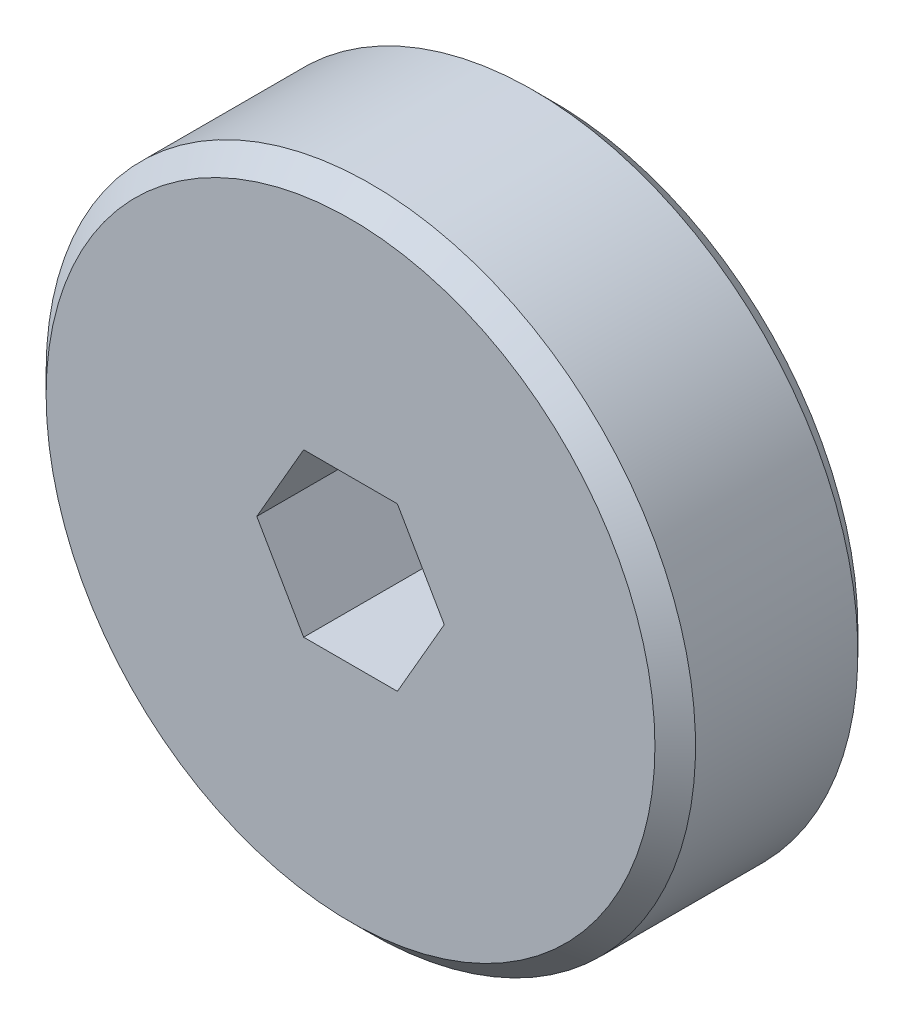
ISO-10303-21;
HEADER;
FILE_DESCRIPTION(('STEP AP214'),'2;1');
FILE_NAME('part.step','',(''),(''),'','','');
FILE_SCHEMA(('AUTOMOTIVE_DESIGN { 1 0 10303 214 1 1 1 1 }'));
ENDSEC;
DATA;
#1=APPLICATION_CONTEXT('core data for automotive mechanical design processes');
#2=APPLICATION_PROTOCOL_DEFINITION('international standard','automotive_design',2000,#1);
#3=PRODUCT_CONTEXT('',#1,'mechanical');
#4=PRODUCT('Part','Part','',(#3));
#5=PRODUCT_RELATED_PRODUCT_CATEGORY('part','',(#4));
#6=PRODUCT_DEFINITION_FORMATION('','',#4);
#7=PRODUCT_DEFINITION_CONTEXT('part definition',#1,'design');
#8=PRODUCT_DEFINITION('design','',#6,#7);
#9=PRODUCT_DEFINITION_SHAPE('','',#8);
#10=(LENGTH_UNIT() NAMED_UNIT(*) SI_UNIT(.MILLI.,.METRE.));
#11=(NAMED_UNIT(*) PLANE_ANGLE_UNIT() SI_UNIT($,.RADIAN.));
#12=(NAMED_UNIT(*) SI_UNIT($,.STERADIAN.) SOLID_ANGLE_UNIT());
#13=UNCERTAINTY_MEASURE_WITH_UNIT(LENGTH_MEASURE(1.E-05),#10,'distance_accuracy_value','');
#14=(GEOMETRIC_REPRESENTATION_CONTEXT(3) GLOBAL_UNCERTAINTY_ASSIGNED_CONTEXT((#13)) GLOBAL_UNIT_ASSIGNED_CONTEXT((#10,
#11,#12)) REPRESENTATION_CONTEXT('',''));
#15=CARTESIAN_POINT('',(0.,0.,0.));
#16=DIRECTION('',(0.,0.,1.));
#17=DIRECTION('',(1.,0.,0.));
#18=AXIS2_PLACEMENT_3D('',#15,#16,#17);
#19=CARTESIAN_POINT('',(0.,0.,0.));
#20=DIRECTION('',(0.,0.,1.));
#21=DIRECTION('',(1.,0.,0.));
#22=AXIS2_PLACEMENT_3D('',#19,#20,#21);
#23=PLANE('',#22);
#24=DIRECTION('',(-0.5,-0.866025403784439,0.));
#25=VECTOR('',#24,1.);
#26=CARTESIAN_POINT('',(3.66617420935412,0.,0.));
#27=LINE('',#26,#25);
#28=CARTESIAN_POINT('',(3.66617420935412,0.,0.));
#29=VERTEX_POINT('',#28);
#30=CARTESIAN_POINT('',(1.83308710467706,-3.175,0.));
#31=VERTEX_POINT('',#30);
#32=EDGE_CURVE('E132',#29,#31,#27,.T.);
#33=ORIENTED_EDGE('',*,*,#32,.F.);
#34=DIRECTION('',(0.5,-0.866025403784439,0.));
#35=VECTOR('',#34,1.);
#36=CARTESIAN_POINT('',(1.83308710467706,3.175,0.));
#37=LINE('',#36,#35);
#38=CARTESIAN_POINT('',(1.83308710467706,3.175,0.));
#39=VERTEX_POINT('',#38);
#40=EDGE_CURVE('E61',#39,#29,#37,.T.);
#41=ORIENTED_EDGE('',*,*,#40,.F.);
#42=DIRECTION('',(1.,0.,0.));
#43=VECTOR('',#42,1.);
#44=CARTESIAN_POINT('',(-1.83308710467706,3.175,0.));
#45=LINE('',#44,#43);
#46=CARTESIAN_POINT('',(-1.83308710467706,3.175,0.));
#47=VERTEX_POINT('',#46);
#48=EDGE_CURVE('E118',#47,#39,#45,.T.);
#49=ORIENTED_EDGE('',*,*,#48,.F.);
#50=DIRECTION('',(0.5,0.866025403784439,0.));
#51=VECTOR('',#50,1.);
#52=CARTESIAN_POINT('',(-3.66617420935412,0.,0.));
#53=LINE('',#52,#51);
#54=CARTESIAN_POINT('',(-3.66617420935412,0.,0.));
#55=VERTEX_POINT('',#54);
#56=EDGE_CURVE('E121',#55,#47,#53,.T.);
#57=ORIENTED_EDGE('',*,*,#56,.F.);
#58=DIRECTION('',(-0.5,0.866025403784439,0.));
#59=VECTOR('',#58,1.);
#60=CARTESIAN_POINT('',(-1.83308710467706,-3.175,0.));
#61=LINE('',#60,#59);
#62=CARTESIAN_POINT('',(-1.83308710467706,-3.175,0.));
#63=VERTEX_POINT('',#62);
#64=EDGE_CURVE('E137',#63,#55,#61,.T.);
#65=ORIENTED_EDGE('',*,*,#64,.F.);
#66=DIRECTION('',(-1.,0.,0.));
#67=VECTOR('',#66,1.);
#68=CARTESIAN_POINT('',(1.83308710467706,-3.175,0.));
#69=LINE('',#68,#67);
#70=EDGE_CURVE('E134',#31,#63,#69,.T.);
#71=ORIENTED_EDGE('',*,*,#70,.F.);
#72=EDGE_LOOP('',(#33,#41,#49,#57,#65,#71));
#73=FACE_BOUND('',#72,.T.);
#74=CARTESIAN_POINT('',(0.,0.,0.));
#75=DIRECTION('',(0.,0.,-1.));
#76=DIRECTION('',(-1.,0.,0.));
#77=AXIS2_PLACEMENT_3D('',#74,#75,#76);
#78=CIRCLE('',#77,11.90625);
#79=CARTESIAN_POINT('',(-11.90625,0.,0.));
#80=VERTEX_POINT('',#79);
#81=EDGE_CURVE('E11',#80,#80,#78,.T.);
#82=ORIENTED_EDGE('',*,*,#81,.T.);
#83=EDGE_LOOP('',(#82));
#84=FACE_BOUND('',#83,.T.);
#85=ADVANCED_FACE('F47',(#73,#84),#23,.F.);
#86=CARTESIAN_POINT('',(0.,0.,0.793749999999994));
#87=DIRECTION('',(0.,0.,1.));
#88=DIRECTION('',(1.,0.,0.));
#89=AXIS2_PLACEMENT_3D('',#86,#87,#88);
#90=CONICAL_SURFACE('',#89,12.7,0.78539816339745);
#91=ORIENTED_EDGE('',*,*,#81,.F.);
#92=EDGE_LOOP('',(#91));
#93=FACE_BOUND('',#92,.T.);
#94=CARTESIAN_POINT('',(0.,0.,0.793749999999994));
#95=DIRECTION('',(0.,0.,-1.));
#96=DIRECTION('',(-1.,0.,0.));
#97=AXIS2_PLACEMENT_3D('',#94,#95,#96);
#98=CIRCLE('',#97,12.7);
#99=CARTESIAN_POINT('',(-12.7,0.,0.793749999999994));
#100=VERTEX_POINT('',#99);
#101=EDGE_CURVE('E54',#100,#100,#98,.T.);
#102=ORIENTED_EDGE('',*,*,#101,.T.);
#103=EDGE_LOOP('',(#102));
#104=FACE_BOUND('',#103,.T.);
#105=ADVANCED_FACE('F159',(#93,#104),#90,.T.);
#106=CARTESIAN_POINT('',(0.,0.,-10.585154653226));
#107=DIRECTION('',(0.,0.,-1.));
#108=DIRECTION('',(-1.,0.,0.));
#109=AXIS2_PLACEMENT_3D('',#106,#107,#108);
#110=CYLINDRICAL_SURFACE('',#109,12.7);
#111=ORIENTED_EDGE('',*,*,#101,.F.);
#112=EDGE_LOOP('',(#111));
#113=FACE_BOUND('',#112,.T.);
#114=CARTESIAN_POINT('',(0.,0.,7.14374999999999));
#115=DIRECTION('',(0.,0.,-1.));
#116=DIRECTION('',(-1.,0.,0.));
#117=AXIS2_PLACEMENT_3D('',#114,#115,#116);
#118=CIRCLE('',#117,12.7);
#119=CARTESIAN_POINT('',(-12.7,0.,7.14374999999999));
#120=VERTEX_POINT('',#119);
#121=EDGE_CURVE('E154',#120,#120,#118,.T.);
#122=ORIENTED_EDGE('',*,*,#121,.T.);
#123=EDGE_LOOP('',(#122));
#124=FACE_BOUND('',#123,.T.);
#125=ADVANCED_FACE('F161',(#113,#124),#110,.T.);
#126=CARTESIAN_POINT('',(0.,0.,7.9375));
#127=DIRECTION('',(0.,0.,-1.));
#128=DIRECTION('',(-1.,0.,0.));
#129=AXIS2_PLACEMENT_3D('',#126,#127,#128);
#130=CONICAL_SURFACE('',#129,11.90625,0.785398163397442);
#131=ORIENTED_EDGE('',*,*,#121,.F.);
#132=EDGE_LOOP('',(#131));
#133=FACE_BOUND('',#132,.T.);
#134=CARTESIAN_POINT('',(0.,0.,7.9375));
#135=DIRECTION('',(0.,0.,-1.));
#136=DIRECTION('',(-1.,0.,0.));
#137=AXIS2_PLACEMENT_3D('',#134,#135,#136);
#138=CIRCLE('',#137,11.90625);
#139=CARTESIAN_POINT('',(-11.90625,0.,7.9375));
#140=VERTEX_POINT('',#139);
#141=EDGE_CURVE('E144',#140,#140,#138,.T.);
#142=ORIENTED_EDGE('',*,*,#141,.T.);
#143=EDGE_LOOP('',(#142));
#144=FACE_BOUND('',#143,.T.);
#145=ADVANCED_FACE('F164',(#133,#144),#130,.T.);
#146=CARTESIAN_POINT('',(-11.90625,0.,7.9375));
#147=DIRECTION('',(0.,0.,-1.));
#148=DIRECTION('',(-1.,0.,0.));
#149=AXIS2_PLACEMENT_3D('',#146,#147,#148);
#150=PLANE('',#149);
#151=DIRECTION('',(1.,0.,0.));
#152=VECTOR('',#151,1.);
#153=CARTESIAN_POINT('',(-1.83308710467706,3.175,7.9375));
#154=LINE('',#153,#152);
#155=CARTESIAN_POINT('',(-1.83308710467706,3.175,7.9375));
#156=VERTEX_POINT('',#155);
#157=CARTESIAN_POINT('',(1.83308710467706,3.175,7.9375));
#158=VERTEX_POINT('',#157);
#159=EDGE_CURVE('E107',#156,#158,#154,.T.);
#160=ORIENTED_EDGE('',*,*,#159,.T.);
#161=DIRECTION('',(0.5,-0.866025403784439,0.));
#162=VECTOR('',#161,1.);
#163=CARTESIAN_POINT('',(1.83308710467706,3.175,7.9375));
#164=LINE('',#163,#162);
#165=CARTESIAN_POINT('',(3.66617420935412,0.,7.9375));
#166=VERTEX_POINT('',#165);
#167=EDGE_CURVE('E101',#158,#166,#164,.T.);
#168=ORIENTED_EDGE('',*,*,#167,.T.);
#169=DIRECTION('',(-0.5,-0.866025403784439,0.));
#170=VECTOR('',#169,1.);
#171=CARTESIAN_POINT('',(3.66617420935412,0.,7.9375));
#172=LINE('',#171,#170);
#173=CARTESIAN_POINT('',(1.83308710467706,-3.175,7.9375));
#174=VERTEX_POINT('',#173);
#175=EDGE_CURVE('E110',#166,#174,#172,.T.);
#176=ORIENTED_EDGE('',*,*,#175,.T.);
#177=DIRECTION('',(-1.,0.,0.));
#178=VECTOR('',#177,1.);
#179=CARTESIAN_POINT('',(1.83308710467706,-3.175,7.9375));
#180=LINE('',#179,#178);
#181=CARTESIAN_POINT('',(-1.83308710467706,-3.175,7.9375));
#182=VERTEX_POINT('',#181);
#183=EDGE_CURVE('E69',#174,#182,#180,.T.);
#184=ORIENTED_EDGE('',*,*,#183,.T.);
#185=DIRECTION('',(-0.5,0.866025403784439,0.));
#186=VECTOR('',#185,1.);
#187=CARTESIAN_POINT('',(-1.83308710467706,-3.175,7.9375));
#188=LINE('',#187,#186);
#189=CARTESIAN_POINT('',(-3.66617420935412,0.,7.9375));
#190=VERTEX_POINT('',#189);
#191=EDGE_CURVE('E125',#182,#190,#188,.T.);
#192=ORIENTED_EDGE('',*,*,#191,.T.);
#193=DIRECTION('',(0.5,0.866025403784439,0.));
#194=VECTOR('',#193,1.);
#195=CARTESIAN_POINT('',(-3.66617420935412,0.,7.9375));
#196=LINE('',#195,#194);
#197=EDGE_CURVE('E128',#190,#156,#196,.T.);
#198=ORIENTED_EDGE('',*,*,#197,.T.);
#199=EDGE_LOOP('',(#160,#168,#176,#184,#192,#198));
#200=FACE_BOUND('',#199,.T.);
#201=ORIENTED_EDGE('',*,*,#141,.F.);
#202=EDGE_LOOP('',(#201));
#203=FACE_BOUND('',#202,.T.);
#204=ADVANCED_FACE('F114',(#200,#203),#150,.F.);
#205=CARTESIAN_POINT('',(1.83308710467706,3.175,7.9375));
#206=DIRECTION('',(0.866025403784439,0.5,0.));
#207=DIRECTION('',(-0.5,0.866025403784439,0.));
#208=AXIS2_PLACEMENT_3D('',#205,#206,#207);
#209=PLANE('',#208);
#210=ORIENTED_EDGE('',*,*,#40,.T.);
#211=DIRECTION('',(0.,0.,-1.));
#212=VECTOR('',#211,1.);
#213=CARTESIAN_POINT('',(3.66617420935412,0.,7.9375));
#214=LINE('',#213,#212);
#215=EDGE_CURVE('E97',#166,#29,#214,.T.);
#216=ORIENTED_EDGE('',*,*,#215,.F.);
#217=ORIENTED_EDGE('',*,*,#167,.F.);
#218=DIRECTION('',(0.,0.,-1.));
#219=VECTOR('',#218,1.);
#220=CARTESIAN_POINT('',(1.83308710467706,3.175,7.9375));
#221=LINE('',#220,#219);
#222=EDGE_CURVE('E142',#158,#39,#221,.T.);
#223=ORIENTED_EDGE('',*,*,#222,.T.);
#224=EDGE_LOOP('',(#210,#216,#217,#223));
#225=FACE_BOUND('',#224,.T.);
#226=ADVANCED_FACE('F99',(#225),#209,.F.);
#227=CARTESIAN_POINT('',(-1.83308710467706,3.175,7.9375));
#228=DIRECTION('',(0.,1.,0.));
#229=DIRECTION('',(-1.,0.,0.));
#230=AXIS2_PLACEMENT_3D('',#227,#228,#229);
#231=PLANE('',#230);
#232=ORIENTED_EDGE('',*,*,#48,.T.);
#233=ORIENTED_EDGE('',*,*,#222,.F.);
#234=ORIENTED_EDGE('',*,*,#159,.F.);
#235=DIRECTION('',(0.,0.,-1.));
#236=VECTOR('',#235,1.);
#237=CARTESIAN_POINT('',(-1.83308710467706,3.175,7.9375));
#238=LINE('',#237,#236);
#239=EDGE_CURVE('E145',#156,#47,#238,.T.);
#240=ORIENTED_EDGE('',*,*,#239,.T.);
#241=EDGE_LOOP('',(#232,#233,#234,#240));
#242=FACE_BOUND('',#241,.T.);
#243=ADVANCED_FACE('F179',(#242),#231,.F.);
#244=CARTESIAN_POINT('',(-3.66617420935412,0.,7.9375));
#245=DIRECTION('',(-0.866025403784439,0.5,0.));
#246=DIRECTION('',(-0.5,-0.866025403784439,0.));
#247=AXIS2_PLACEMENT_3D('',#244,#245,#246);
#248=PLANE('',#247);
#249=ORIENTED_EDGE('',*,*,#56,.T.);
#250=ORIENTED_EDGE('',*,*,#239,.F.);
#251=ORIENTED_EDGE('',*,*,#197,.F.);
#252=DIRECTION('',(0.,0.,-1.));
#253=VECTOR('',#252,1.);
#254=CARTESIAN_POINT('',(-3.66617420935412,0.,7.9375));
#255=LINE('',#254,#253);
#256=EDGE_CURVE('E147',#190,#55,#255,.T.);
#257=ORIENTED_EDGE('',*,*,#256,.T.);
#258=EDGE_LOOP('',(#249,#250,#251,#257));
#259=FACE_BOUND('',#258,.T.);
#260=ADVANCED_FACE('F198',(#259),#248,.F.);
#261=CARTESIAN_POINT('',(-1.83308710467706,-3.175,7.9375));
#262=DIRECTION('',(-0.866025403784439,-0.5,0.));
#263=DIRECTION('',(0.5,-0.866025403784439,0.));
#264=AXIS2_PLACEMENT_3D('',#261,#262,#263);
#265=PLANE('',#264);
#266=ORIENTED_EDGE('',*,*,#64,.T.);
#267=ORIENTED_EDGE('',*,*,#256,.F.);
#268=ORIENTED_EDGE('',*,*,#191,.F.);
#269=DIRECTION('',(0.,0.,-1.));
#270=VECTOR('',#269,1.);
#271=CARTESIAN_POINT('',(-1.83308710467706,-3.175,7.9375));
#272=LINE('',#271,#270);
#273=EDGE_CURVE('E149',#182,#63,#272,.T.);
#274=ORIENTED_EDGE('',*,*,#273,.T.);
#275=EDGE_LOOP('',(#266,#267,#268,#274));
#276=FACE_BOUND('',#275,.T.);
#277=ADVANCED_FACE('F195',(#276),#265,.F.);
#278=CARTESIAN_POINT('',(1.83308710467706,-3.175,7.9375));
#279=DIRECTION('',(0.,-1.,0.));
#280=DIRECTION('',(1.,0.,0.));
#281=AXIS2_PLACEMENT_3D('',#278,#279,#280);
#282=PLANE('',#281);
#283=ORIENTED_EDGE('',*,*,#70,.T.);
#284=ORIENTED_EDGE('',*,*,#273,.F.);
#285=ORIENTED_EDGE('',*,*,#183,.F.);
#286=DIRECTION('',(0.,0.,-1.));
#287=VECTOR('',#286,1.);
#288=CARTESIAN_POINT('',(1.83308710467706,-3.175,7.9375));
#289=LINE('',#288,#287);
#290=EDGE_CURVE('E106',#174,#31,#289,.T.);
#291=ORIENTED_EDGE('',*,*,#290,.T.);
#292=EDGE_LOOP('',(#283,#284,#285,#291));
#293=FACE_BOUND('',#292,.T.);
#294=ADVANCED_FACE('F192',(#293),#282,.F.);
#295=CARTESIAN_POINT('',(3.66617420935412,0.,7.9375));
#296=DIRECTION('',(0.866025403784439,-0.5,0.));
#297=DIRECTION('',(0.5,0.866025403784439,0.));
#298=AXIS2_PLACEMENT_3D('',#295,#296,#297);
#299=PLANE('',#298);
#300=ORIENTED_EDGE('',*,*,#32,.T.);
#301=ORIENTED_EDGE('',*,*,#290,.F.);
#302=ORIENTED_EDGE('',*,*,#175,.F.);
#303=ORIENTED_EDGE('',*,*,#215,.T.);
#304=EDGE_LOOP('',(#300,#301,#302,#303));
#305=FACE_BOUND('',#304,.T.);
#306=ADVANCED_FACE('F111',(#305),#299,.F.);
#307=CLOSED_SHELL('',(#85,#105,#125,#145,#204,#226,#243,#260,#277,#294,#306));
#308=MANIFOLD_SOLID_BREP('B2',#307);
#309=ADVANCED_BREP_SHAPE_REPRESENTATION('',(#18,#308),#14);
#310=SHAPE_DEFINITION_REPRESENTATION(#9,#309);
ENDSEC;
END-ISO-10303-21;
